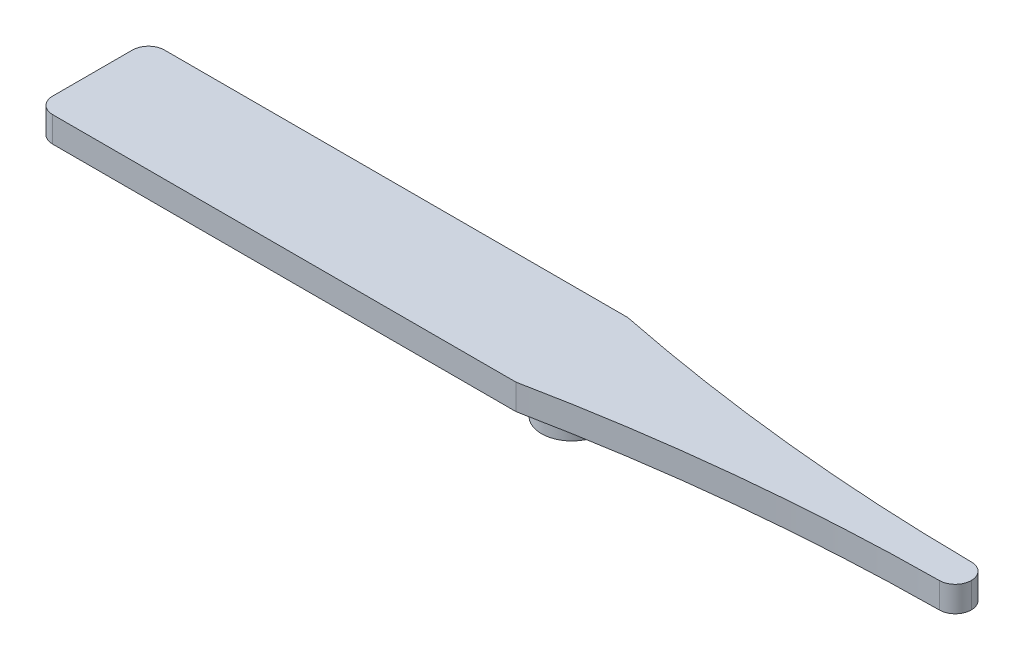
from build123d import *

# Parameters (mm, degrees)
AUFSATZ_LINEAR_AUSTRAGEN1_DEPTH = 1.6
SKIZZE1_4_R                     = 1.9
AUFSATZ_LINEAR_AUSTRAGEN2_DEPTH = 2
VERRUNDUNG1_R                   = 1


with BuildPart() as part:
    # Skizze1 → Aufsatz-Linear austragen1 (new body)
    with BuildSketch(Plane(origin=(0, 0, 0), x_dir=(1, 0, 0), z_dir=(0, 1, 0))):
        with BuildLine():
            Line((-30, -3.5), (0, -3.5))
            ThreePointArc((0, -3.5), (12.437655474, -1.626554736), (25, -1))
            Line((25, -1), (25, 1))
            ThreePointArc((25, 1), (12.437655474, 1.626554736), (0, 3.5))
            Line((0, 3.5), (-30, 3.5))
            Line((-30, 3.5), (-30, -3.5))
        make_face()
    extrude(amount=AUFSATZ_LINEAR_AUSTRAGEN1_DEPTH)

    # Skizze1_4 → Aufsatz-Linear austragen2 (add)
    with BuildSketch(Plane(origin=(0, 0, 0), x_dir=(1, 0, 0), z_dir=(0, 1, 0))):
        with Locations(Location((0, 0, 0), (0, 0, 270))):
            Circle(SKIZZE1_4_R)
    extrude(amount=-AUFSATZ_LINEAR_AUSTRAGEN2_DEPTH)

    # Verrundung1
    verrundung1_edges = [part.edges().sort_by_distance(p)[0] for p in [
        (25, 0.8, 1),
        (-30, 0.8, 3.5),
        (-30, 0.8, -3.5),
        (0, 0.8, -3.5),
        (25, 0.8, -1),
    ]]
    fillet(verrundung1_edges, radius=VERRUNDUNG1_R)


solid = part.part
